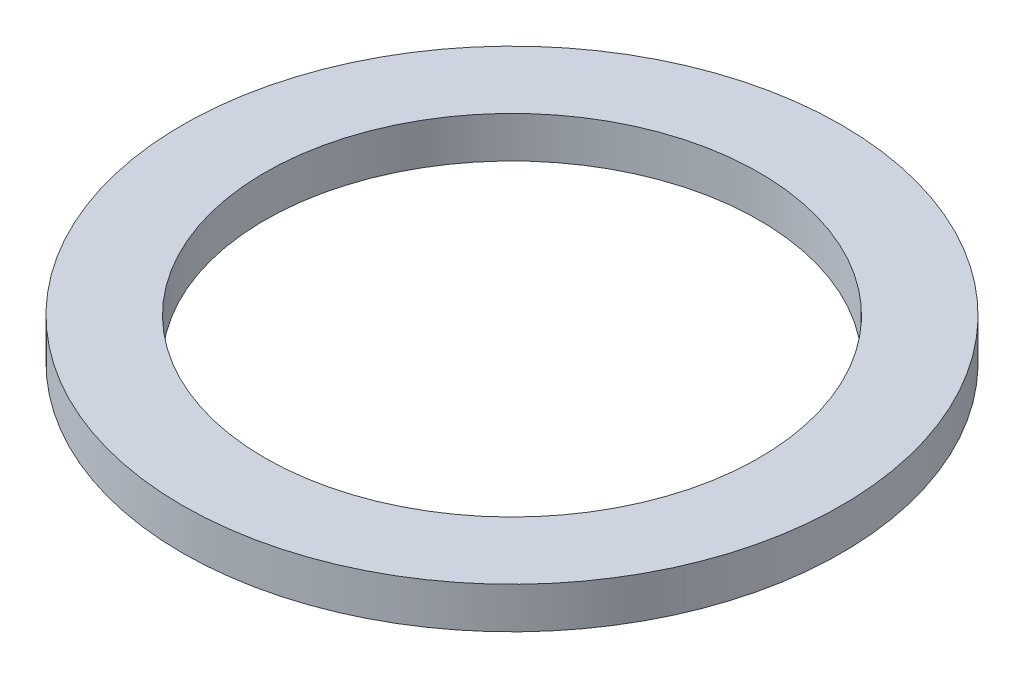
from build123d import *

# Parameters (mm, degrees)
ESQUISSE1_R      = 16
ESQUISSE1_R_2    = 12
EXTRUSION1_DEPTH = 2


with BuildPart() as part:
    # Esquisse1 → Extrusion1 (new body)
    with BuildSketch(Plane(origin=(0, 0, 0), x_dir=(1, 0, 0), z_dir=(0, 1, 0))):
        with Locations(Location((0, 0, 0), (0, 0, 270))):
            Circle(ESQUISSE1_R)
        with Locations(Location((0, 0, 0), (0, 0, 270))):
            Circle(ESQUISSE1_R_2, mode=Mode.SUBTRACT)
    extrude(amount=EXTRUSION1_DEPTH)


solid = part.part
